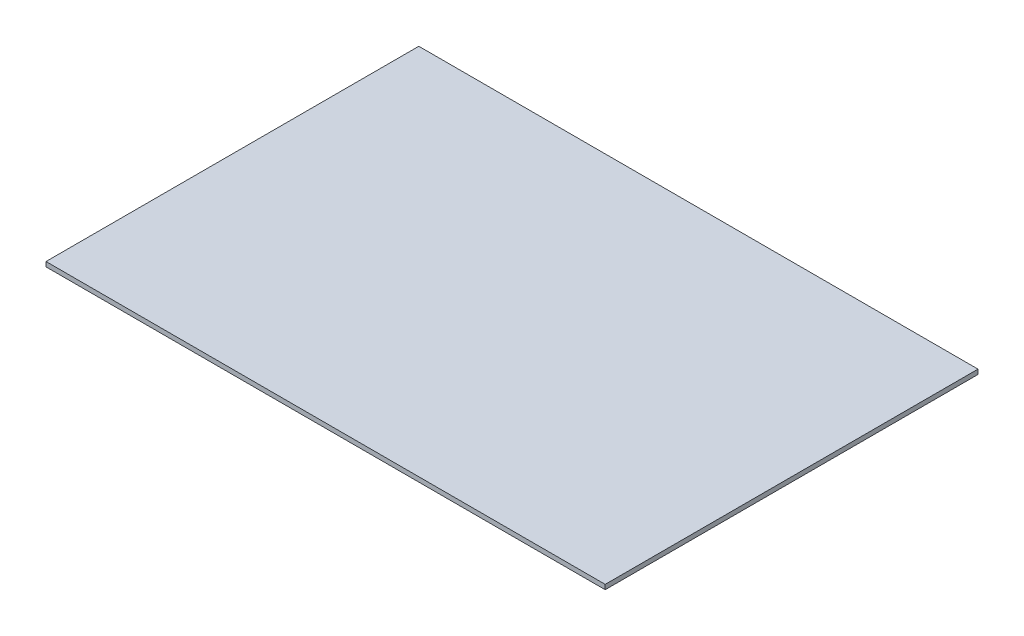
ISO-10303-21;
HEADER;
FILE_DESCRIPTION(('STEP AP214'),'2;1');
FILE_NAME('part.step','',(''),(''),'','','');
FILE_SCHEMA(('AUTOMOTIVE_DESIGN { 1 0 10303 214 1 1 1 1 }'));
ENDSEC;
DATA;
#1=APPLICATION_CONTEXT('core data for automotive mechanical design processes');
#2=APPLICATION_PROTOCOL_DEFINITION('international standard','automotive_design',2000,#1);
#3=PRODUCT_CONTEXT('',#1,'mechanical');
#4=PRODUCT('Part','Part','',(#3));
#5=PRODUCT_RELATED_PRODUCT_CATEGORY('part','',(#4));
#6=PRODUCT_DEFINITION_FORMATION('','',#4);
#7=PRODUCT_DEFINITION_CONTEXT('part definition',#1,'design');
#8=PRODUCT_DEFINITION('design','',#6,#7);
#9=PRODUCT_DEFINITION_SHAPE('','',#8);
#10=(LENGTH_UNIT() NAMED_UNIT(*) SI_UNIT(.MILLI.,.METRE.));
#11=(NAMED_UNIT(*) PLANE_ANGLE_UNIT() SI_UNIT($,.RADIAN.));
#12=(NAMED_UNIT(*) SI_UNIT($,.STERADIAN.) SOLID_ANGLE_UNIT());
#13=UNCERTAINTY_MEASURE_WITH_UNIT(LENGTH_MEASURE(1.E-05),#10,'distance_accuracy_value','');
#14=(GEOMETRIC_REPRESENTATION_CONTEXT(3) GLOBAL_UNCERTAINTY_ASSIGNED_CONTEXT((#13)) GLOBAL_UNIT_ASSIGNED_CONTEXT((#10,
#11,#12)) REPRESENTATION_CONTEXT('',''));
#15=CARTESIAN_POINT('',(0.,0.,0.));
#16=DIRECTION('',(0.,0.,1.));
#17=DIRECTION('',(1.,0.,0.));
#18=AXIS2_PLACEMENT_3D('',#15,#16,#17);
#19=CARTESIAN_POINT('',(381.,6.35,254.));
#20=DIRECTION('',(-1.,0.,0.));
#21=DIRECTION('',(0.,0.,1.));
#22=AXIS2_PLACEMENT_3D('',#19,#20,#21);
#23=PLANE('',#22);
#24=DIRECTION('',(0.,0.,-1.));
#25=VECTOR('',#24,1.);
#26=CARTESIAN_POINT('',(381.,0.,254.));
#27=LINE('',#26,#25);
#28=CARTESIAN_POINT('',(381.,0.,254.));
#29=VERTEX_POINT('',#28);
#30=CARTESIAN_POINT('',(381.,0.,-254.));
#31=VERTEX_POINT('',#30);
#32=EDGE_CURVE('E101',#29,#31,#27,.T.);
#33=ORIENTED_EDGE('',*,*,#32,.T.);
#34=DIRECTION('',(0.,-1.,0.));
#35=VECTOR('',#34,1.);
#36=CARTESIAN_POINT('',(381.,6.35,-254.));
#37=LINE('',#36,#35);
#38=CARTESIAN_POINT('',(381.,6.35,-254.));
#39=VERTEX_POINT('',#38);
#40=EDGE_CURVE('E11',#39,#31,#37,.T.);
#41=ORIENTED_EDGE('',*,*,#40,.F.);
#42=DIRECTION('',(0.,0.,-1.));
#43=VECTOR('',#42,1.);
#44=CARTESIAN_POINT('',(381.,6.35,254.));
#45=LINE('',#44,#43);
#46=CARTESIAN_POINT('',(381.,6.35,254.));
#47=VERTEX_POINT('',#46);
#48=EDGE_CURVE('E89',#47,#39,#45,.T.);
#49=ORIENTED_EDGE('',*,*,#48,.F.);
#50=DIRECTION('',(0.,-1.,0.));
#51=VECTOR('',#50,1.);
#52=CARTESIAN_POINT('',(381.,6.35,254.));
#53=LINE('',#52,#51);
#54=EDGE_CURVE('E97',#47,#29,#53,.T.);
#55=ORIENTED_EDGE('',*,*,#54,.T.);
#56=EDGE_LOOP('',(#33,#41,#49,#55));
#57=FACE_BOUND('',#56,.T.);
#58=ADVANCED_FACE('F38',(#57),#23,.F.);
#59=CARTESIAN_POINT('',(-381.,6.35,-254.));
#60=DIRECTION('',(0.,0.,1.));
#61=DIRECTION('',(1.,0.,0.));
#62=AXIS2_PLACEMENT_3D('',#59,#60,#61);
#63=PLANE('',#62);
#64=DIRECTION('',(-1.,0.,0.));
#65=VECTOR('',#64,1.);
#66=CARTESIAN_POINT('',(-381.,0.,-254.));
#67=LINE('',#66,#65);
#68=CARTESIAN_POINT('',(-381.,0.,-254.));
#69=VERTEX_POINT('',#68);
#70=EDGE_CURVE('E93',#31,#69,#67,.T.);
#71=ORIENTED_EDGE('',*,*,#70,.T.);
#72=DIRECTION('',(0.,-1.,0.));
#73=VECTOR('',#72,1.);
#74=CARTESIAN_POINT('',(-381.,6.35,-254.));
#75=LINE('',#74,#73);
#76=CARTESIAN_POINT('',(-381.,6.35,-254.));
#77=VERTEX_POINT('',#76);
#78=EDGE_CURVE('E46',#77,#69,#75,.T.);
#79=ORIENTED_EDGE('',*,*,#78,.F.);
#80=DIRECTION('',(-1.,0.,0.));
#81=VECTOR('',#80,1.);
#82=CARTESIAN_POINT('',(-381.,6.35,-254.));
#83=LINE('',#82,#81);
#84=EDGE_CURVE('E84',#39,#77,#83,.T.);
#85=ORIENTED_EDGE('',*,*,#84,.F.);
#86=ORIENTED_EDGE('',*,*,#40,.T.);
#87=EDGE_LOOP('',(#71,#79,#85,#86));
#88=FACE_BOUND('',#87,.T.);
#89=ADVANCED_FACE('F92',(#88),#63,.F.);
#90=CARTESIAN_POINT('',(-381.,6.35,254.));
#91=DIRECTION('',(1.,0.,0.));
#92=DIRECTION('',(0.,0.,-1.));
#93=AXIS2_PLACEMENT_3D('',#90,#91,#92);
#94=PLANE('',#93);
#95=DIRECTION('',(0.,0.,1.));
#96=VECTOR('',#95,1.);
#97=CARTESIAN_POINT('',(-381.,0.,254.));
#98=LINE('',#97,#96);
#99=CARTESIAN_POINT('',(-381.,0.,254.));
#100=VERTEX_POINT('',#99);
#101=EDGE_CURVE('E71',#69,#100,#98,.T.);
#102=ORIENTED_EDGE('',*,*,#101,.T.);
#103=DIRECTION('',(0.,-1.,0.));
#104=VECTOR('',#103,1.);
#105=CARTESIAN_POINT('',(-381.,6.35,254.));
#106=LINE('',#105,#104);
#107=CARTESIAN_POINT('',(-381.,6.35,254.));
#108=VERTEX_POINT('',#107);
#109=EDGE_CURVE('E94',#108,#100,#106,.T.);
#110=ORIENTED_EDGE('',*,*,#109,.F.);
#111=DIRECTION('',(0.,0.,1.));
#112=VECTOR('',#111,1.);
#113=CARTESIAN_POINT('',(-381.,6.35,254.));
#114=LINE('',#113,#112);
#115=EDGE_CURVE('E87',#77,#108,#114,.T.);
#116=ORIENTED_EDGE('',*,*,#115,.F.);
#117=ORIENTED_EDGE('',*,*,#78,.T.);
#118=EDGE_LOOP('',(#102,#110,#116,#117));
#119=FACE_BOUND('',#118,.T.);
#120=ADVANCED_FACE('F95',(#119),#94,.F.);
#121=CARTESIAN_POINT('',(-381.,6.35,254.));
#122=DIRECTION('',(0.,0.,-1.));
#123=DIRECTION('',(-1.,0.,0.));
#124=AXIS2_PLACEMENT_3D('',#121,#122,#123);
#125=PLANE('',#124);
#126=DIRECTION('',(1.,0.,0.));
#127=VECTOR('',#126,1.);
#128=CARTESIAN_POINT('',(-381.,0.,254.));
#129=LINE('',#128,#127);
#130=EDGE_CURVE('E77',#100,#29,#129,.T.);
#131=ORIENTED_EDGE('',*,*,#130,.T.);
#132=ORIENTED_EDGE('',*,*,#54,.F.);
#133=DIRECTION('',(1.,0.,0.));
#134=VECTOR('',#133,1.);
#135=CARTESIAN_POINT('',(-381.,6.35,254.));
#136=LINE('',#135,#134);
#137=EDGE_CURVE('E54',#108,#47,#136,.T.);
#138=ORIENTED_EDGE('',*,*,#137,.F.);
#139=ORIENTED_EDGE('',*,*,#109,.T.);
#140=EDGE_LOOP('',(#131,#132,#138,#139));
#141=FACE_BOUND('',#140,.T.);
#142=ADVANCED_FACE('F108',(#141),#125,.F.);
#143=CARTESIAN_POINT('',(0.,6.35,0.));
#144=DIRECTION('',(0.,-1.,0.));
#145=DIRECTION('',(0.,0.,-1.));
#146=AXIS2_PLACEMENT_3D('',#143,#144,#145);
#147=PLANE('',#146);
#148=ORIENTED_EDGE('',*,*,#48,.T.);
#149=ORIENTED_EDGE('',*,*,#84,.T.);
#150=ORIENTED_EDGE('',*,*,#115,.T.);
#151=ORIENTED_EDGE('',*,*,#137,.T.);
#152=EDGE_LOOP('',(#148,#149,#150,#151));
#153=FACE_BOUND('',#152,.T.);
#154=ADVANCED_FACE('F85',(#153),#147,.F.);
#155=CARTESIAN_POINT('',(0.,0.,0.));
#156=DIRECTION('',(0.,-1.,0.));
#157=DIRECTION('',(0.,0.,-1.));
#158=AXIS2_PLACEMENT_3D('',#155,#156,#157);
#159=PLANE('',#158);
#160=ORIENTED_EDGE('',*,*,#32,.F.);
#161=ORIENTED_EDGE('',*,*,#130,.F.);
#162=ORIENTED_EDGE('',*,*,#101,.F.);
#163=ORIENTED_EDGE('',*,*,#70,.F.);
#164=EDGE_LOOP('',(#160,#161,#162,#163));
#165=FACE_BOUND('',#164,.T.);
#166=ADVANCED_FACE('F111',(#165),#159,.T.);
#167=CLOSED_SHELL('',(#58,#89,#120,#142,#154,#166));
#168=MANIFOLD_SOLID_BREP('B2',#167);
#169=ADVANCED_BREP_SHAPE_REPRESENTATION('',(#18,#168),#14);
#170=SHAPE_DEFINITION_REPRESENTATION(#9,#169);
ENDSEC;
END-ISO-10303-21;
